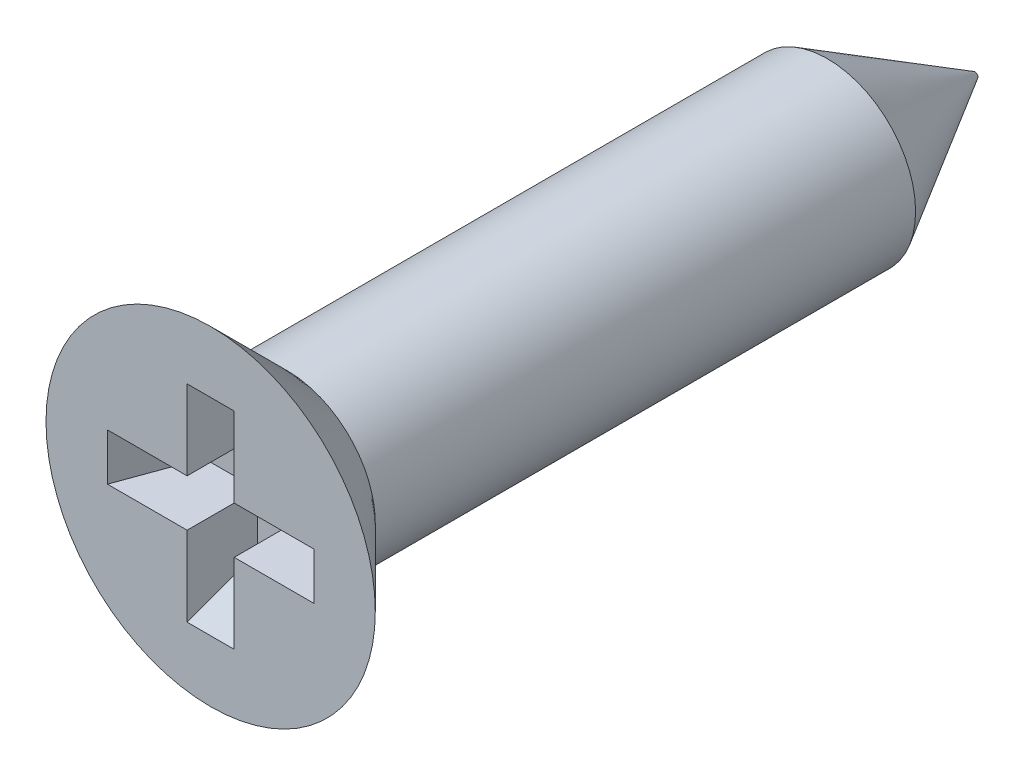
ISO-10303-21;
HEADER;
FILE_DESCRIPTION(('STEP AP214'),'2;1');
FILE_NAME('part.step','',(''),(''),'','','');
FILE_SCHEMA(('AUTOMOTIVE_DESIGN { 1 0 10303 214 1 1 1 1 }'));
ENDSEC;
DATA;
#1=APPLICATION_CONTEXT('core data for automotive mechanical design processes');
#2=APPLICATION_PROTOCOL_DEFINITION('international standard','automotive_design',2000,#1);
#3=PRODUCT_CONTEXT('',#1,'mechanical');
#4=PRODUCT('Part','Part','',(#3));
#5=PRODUCT_RELATED_PRODUCT_CATEGORY('part','',(#4));
#6=PRODUCT_DEFINITION_FORMATION('','',#4);
#7=PRODUCT_DEFINITION_CONTEXT('part definition',#1,'design');
#8=PRODUCT_DEFINITION('design','',#6,#7);
#9=PRODUCT_DEFINITION_SHAPE('','',#8);
#10=(LENGTH_UNIT() NAMED_UNIT(*) SI_UNIT(.MILLI.,.METRE.));
#11=(NAMED_UNIT(*) PLANE_ANGLE_UNIT() SI_UNIT($,.RADIAN.));
#12=(NAMED_UNIT(*) SI_UNIT($,.STERADIAN.) SOLID_ANGLE_UNIT());
#13=UNCERTAINTY_MEASURE_WITH_UNIT(LENGTH_MEASURE(1.E-05),#10,'distance_accuracy_value','');
#14=(GEOMETRIC_REPRESENTATION_CONTEXT(3) GLOBAL_UNCERTAINTY_ASSIGNED_CONTEXT((#13)) GLOBAL_UNIT_ASSIGNED_CONTEXT((#10,
#11,#12)) REPRESENTATION_CONTEXT('',''));
#15=CARTESIAN_POINT('',(0.,0.,0.));
#16=DIRECTION('',(0.,0.,1.));
#17=DIRECTION('',(1.,0.,0.));
#18=AXIS2_PLACEMENT_3D('',#15,#16,#17);
#19=CARTESIAN_POINT('',(0.4,0.4,-1.2));
#20=DIRECTION('',(0.,1.,0.));
#21=DIRECTION('',(-1.,0.,0.));
#22=AXIS2_PLACEMENT_3D('',#19,#20,#21);
#23=PLANE('',#22);
#24=DIRECTION('',(-0.34202014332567,0.,-0.939692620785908));
#25=VECTOR('',#24,1.);
#26=CARTESIAN_POINT('',(1.75499287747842,0.4,0.));
#27=LINE('',#26,#25);
#28=CARTESIAN_POINT('',(1.19429770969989,0.4,-1.54049731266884));
#29=VERTEX_POINT('',#28);
#30=CARTESIAN_POINT('',(1.31822859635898,0.4,-1.2));
#31=VERTEX_POINT('',#30);
#32=EDGE_CURVE('E313',#29,#31,#27,.F.);
#33=ORIENTED_EDGE('',*,*,#32,.T.);
#34=DIRECTION('',(-1.,0.,0.));
#35=VECTOR('',#34,1.);
#36=CARTESIAN_POINT('',(0.4,0.4,-1.2));
#37=LINE('',#36,#35);
#38=CARTESIAN_POINT('',(1.54919333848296,0.4,-1.2));
#39=VERTEX_POINT('',#38);
#40=EDGE_CURVE('E454',#39,#31,#37,.T.);
#41=ORIENTED_EDGE('',*,*,#40,.F.);
#42=CARTESIAN_POINT('',(3.05465508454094,0.4,0.280733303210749));
#43=CARTESIAN_POINT('',(2.93740544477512,0.4,0.164488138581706));
#44=CARTESIAN_POINT('',(2.82011039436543,0.4,0.0482885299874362));
#45=CARTESIAN_POINT('',(2.58535518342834,0.4,-0.183944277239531));
#46=CARTESIAN_POINT('',(2.46789502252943,0.4,-0.299977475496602));
#47=CARTESIAN_POINT('',(2.23276367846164,0.4,-0.531774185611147));
#48=CARTESIAN_POINT('',(2.11509255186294,0.4,-0.647537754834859));
#49=CARTESIAN_POINT('',(1.87936564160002,0.4,-0.878680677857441));
#50=CARTESIAN_POINT('',(1.7613098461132,0.4,-0.994060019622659));
#51=CARTESIAN_POINT('',(1.56030925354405,0.4,-1.18935151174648));
#52=CARTESIAN_POINT('',(1.47753807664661,0.4,-1.26944225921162));
#53=CARTESIAN_POINT('',(1.31147700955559,0.4,-1.42907447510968));
#54=CARTESIAN_POINT('',(1.22818715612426,0.4,-1.5086159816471));
#55=CARTESIAN_POINT('',(1.10255289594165,0.4,-1.62721046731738));
#56=CARTESIAN_POINT('',(1.06055264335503,0.4,-1.66662748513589));
#57=CARTESIAN_POINT('',(0.976229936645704,0.4,-1.74511218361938));
#58=CARTESIAN_POINT('',(0.933907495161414,0.4,-1.7841798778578));
#59=CARTESIAN_POINT('',(0.848803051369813,0.4,-1.86183524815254));
#60=CARTESIAN_POINT('',(0.806020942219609,0.4,-1.90042280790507));
#61=CARTESIAN_POINT('',(0.719742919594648,0.4,-1.97680170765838));
#62=CARTESIAN_POINT('',(0.676246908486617,0.4,-2.01459293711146));
#63=CARTESIAN_POINT('',(0.632267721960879,0.4,-2.05182724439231));
#64=B_SPLINE_CURVE_WITH_KNOTS('',3,(#42,#43,#44,#45,#46,#47,#48,#49,#50,#51,#52,#53,#54,#55,#56,
#57,#58,#59,#60,#61,#62,#63),.UNSPECIFIED.,.F.,.F.,(4,2,2,2,2,2,2,2,2,2,4),(0.,
0.495322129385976,0.990645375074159,1.48585130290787,1.98107259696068,2.32660062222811,
2.67210443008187,2.84490192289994,3.01769267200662,3.19052449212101,3.36338014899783),.UNSPECIFIED.);
#65=CARTESIAN_POINT('',(1.4456832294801,0.4,-1.3));
#66=VERTEX_POINT('',#65);
#67=EDGE_CURVE('E311',#66,#39,#64,.F.);
#68=ORIENTED_EDGE('',*,*,#67,.F.);
#69=EDGE_CURVE('E346',#29,#66,#64,.F.);
#70=ORIENTED_EDGE('',*,*,#69,.F.);
#71=EDGE_LOOP('',(#33,#41,#68,#70));
#72=FACE_BOUND('',#71,.T.);
#73=ADVANCED_FACE('F33',(#72),#23,.T.);
#74=CARTESIAN_POINT('',(0.4,-0.4,-1.2));
#75=DIRECTION('',(0.,-1.,0.));
#76=DIRECTION('',(1.,0.,0.));
#77=AXIS2_PLACEMENT_3D('',#74,#75,#76);
#78=PLANE('',#77);
#79=DIRECTION('',(1.,0.,0.));
#80=VECTOR('',#79,1.);
#81=CARTESIAN_POINT('',(0.4,-0.4,-1.2));
#82=LINE('',#81,#80);
#83=CARTESIAN_POINT('',(1.31822859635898,-0.4,-1.2));
#84=VERTEX_POINT('',#83);
#85=CARTESIAN_POINT('',(1.54919333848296,-0.4,-1.2));
#86=VERTEX_POINT('',#85);
#87=EDGE_CURVE('E450',#84,#86,#82,.T.);
#88=ORIENTED_EDGE('',*,*,#87,.F.);
#89=DIRECTION('',(-0.34202014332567,0.,-0.939692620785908));
#90=VECTOR('',#89,1.);
#91=CARTESIAN_POINT('',(1.21081625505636,-0.4,-1.49511298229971));
#92=LINE('',#91,#90);
#93=CARTESIAN_POINT('',(1.19429770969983,-0.4,-1.54049731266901));
#94=VERTEX_POINT('',#93);
#95=EDGE_CURVE('E304',#94,#84,#92,.F.);
#96=ORIENTED_EDGE('',*,*,#95,.F.);
#97=CARTESIAN_POINT('',(0.63226772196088,-0.4,-2.05182724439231));
#98=CARTESIAN_POINT('',(0.660191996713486,-0.4,-2.02821617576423));
#99=CARTESIAN_POINT('',(0.687907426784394,-0.4,-2.0043616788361));
#100=CARTESIAN_POINT('',(0.743005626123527,-0.4,-1.95627497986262));
#101=CARTESIAN_POINT('',(0.770388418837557,-0.4,-1.93204280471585));
#102=CARTESIAN_POINT('',(0.852162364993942,-0.4,-1.85894632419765));
#103=CARTESIAN_POINT('',(0.906188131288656,-0.4,-1.80967429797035));
#104=CARTESIAN_POINT('',(1.01362648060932,-0.4,-1.71049682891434));
#105=CARTESIAN_POINT('',(1.06703921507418,-0.4,-1.66059154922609));
#106=CARTESIAN_POINT('',(1.17347006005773,-0.4,-1.56035783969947));
#107=CARTESIAN_POINT('',(1.22648815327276,-0.4,-1.51002939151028));
#108=CARTESIAN_POINT('',(1.34024896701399,-0.4,-1.40145173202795));
#109=CARTESIAN_POINT('',(1.40094711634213,-0.4,-1.34315589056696));
#110=CARTESIAN_POINT('',(1.52209811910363,-0.4,-1.22630068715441));
#111=CARTESIAN_POINT('',(1.58255095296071,-0.4,-1.16774130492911));
#112=CARTESIAN_POINT('',(1.76134065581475,-0.4,-0.994030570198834));
#113=CARTESIAN_POINT('',(1.87942666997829,-0.4,-0.878621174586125));
#114=CARTESIAN_POINT('',(2.11521819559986,-0.4,-0.647414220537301));
#115=CARTESIAN_POINT('',(2.23292370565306,-0.4,-0.531616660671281));
#116=CARTESIAN_POINT('',(2.46805734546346,-0.4,-0.299817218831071));
#117=CARTESIAN_POINT('',(2.58548555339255,-0.4,-0.183815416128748));
#118=CARTESIAN_POINT('',(2.82017598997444,-0.4,0.0483535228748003));
#119=CARTESIAN_POINT('',(2.93743822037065,-0.4,0.164520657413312));
#120=CARTESIAN_POINT('',(3.05465508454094,-0.4,0.280733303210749));
#121=B_SPLINE_CURVE_WITH_KNOTS('',3,(#97,#98,#99,#100,#101,#102,#103,#104,#105,#106,#107,#108,
#109,#110,#111,#112,#113,#114,#115,#116,#117,#118,#119,#120),.UNSPECIFIED.,.F.,.F.,(4,2,2,2,2,2,
2,2,2,2,2,4),(0.,0.109700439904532,0.219393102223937,0.438742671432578,0.658036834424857,
0.877340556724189,1.12981526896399,1.38230974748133,1.87765889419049,2.3730098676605,
2.86819872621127,3.36338234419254),.UNSPECIFIED.);
#122=CARTESIAN_POINT('',(1.4456832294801,-0.4,-1.3));
#123=VERTEX_POINT('',#122);
#124=EDGE_CURVE('E410',#123,#94,#121,.F.);
#125=ORIENTED_EDGE('',*,*,#124,.F.);
#126=EDGE_CURVE('E312',#86,#123,#121,.F.);
#127=ORIENTED_EDGE('',*,*,#126,.F.);
#128=EDGE_LOOP('',(#88,#96,#125,#127));
#129=FACE_BOUND('',#128,.T.);
#130=ADVANCED_FACE('F327',(#129),#78,.T.);
#131=CARTESIAN_POINT('',(-0.4,1.75499287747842,-1.2));
#132=DIRECTION('',(-1.,0.,0.));
#133=DIRECTION('',(0.,-1.,0.));
#134=AXIS2_PLACEMENT_3D('',#131,#132,#133);
#135=PLANE('',#134);
#136=DIRECTION('',(0.,-0.34202014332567,-0.939692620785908));
#137=VECTOR('',#136,1.);
#138=CARTESIAN_POINT('',(-0.4,1.75499287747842,0.));
#139=LINE('',#138,#137);
#140=CARTESIAN_POINT('',(-0.4,1.19429770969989,-1.54049731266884));
#141=VERTEX_POINT('',#140);
#142=CARTESIAN_POINT('',(-0.4,1.31822859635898,-1.2));
#143=VERTEX_POINT('',#142);
#144=EDGE_CURVE('E298',#141,#143,#139,.F.);
#145=ORIENTED_EDGE('',*,*,#144,.T.);
#146=DIRECTION('',(0.,-1.,0.));
#147=VECTOR('',#146,1.);
#148=CARTESIAN_POINT('',(-0.4,1.75499287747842,-1.2));
#149=LINE('',#148,#147);
#150=CARTESIAN_POINT('',(-0.4,1.54919333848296,-1.2));
#151=VERTEX_POINT('',#150);
#152=EDGE_CURVE('E462',#151,#143,#149,.T.);
#153=ORIENTED_EDGE('',*,*,#152,.F.);
#154=CARTESIAN_POINT('',(-0.4,3.05465508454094,0.280733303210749));
#155=CARTESIAN_POINT('',(-0.4,2.93740544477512,0.164488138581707));
#156=CARTESIAN_POINT('',(-0.4,2.82011039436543,0.0482885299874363));
#157=CARTESIAN_POINT('',(-0.4,2.58535518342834,-0.183944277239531));
#158=CARTESIAN_POINT('',(-0.4,2.46789502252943,-0.299977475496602));
#159=CARTESIAN_POINT('',(-0.4,2.23276367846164,-0.531774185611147));
#160=CARTESIAN_POINT('',(-0.4,2.11509255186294,-0.647537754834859));
#161=CARTESIAN_POINT('',(-0.4,1.87936564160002,-0.878680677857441));
#162=CARTESIAN_POINT('',(-0.4,1.7613098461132,-0.994060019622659));
#163=CARTESIAN_POINT('',(-0.4,1.56030925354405,-1.18935151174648));
#164=CARTESIAN_POINT('',(-0.4,1.47753807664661,-1.26944225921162));
#165=CARTESIAN_POINT('',(-0.4,1.3114770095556,-1.42907447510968));
#166=CARTESIAN_POINT('',(-0.4,1.22818715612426,-1.5086159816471));
#167=CARTESIAN_POINT('',(-0.4,1.10255289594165,-1.62721046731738));
#168=CARTESIAN_POINT('',(-0.4,1.06055264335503,-1.66662748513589));
#169=CARTESIAN_POINT('',(-0.4,0.976229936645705,-1.74511218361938));
#170=CARTESIAN_POINT('',(-0.4,0.933907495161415,-1.7841798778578));
#171=CARTESIAN_POINT('',(-0.4,0.848803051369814,-1.86183524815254));
#172=CARTESIAN_POINT('',(-0.4,0.80602094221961,-1.90042280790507));
#173=CARTESIAN_POINT('',(-0.4,0.719742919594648,-1.97680170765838));
#174=CARTESIAN_POINT('',(-0.4,0.676246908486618,-2.01459293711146));
#175=CARTESIAN_POINT('',(-0.4,0.63226772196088,-2.05182724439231));
#176=B_SPLINE_CURVE_WITH_KNOTS('',3,(#154,#155,#156,#157,#158,#159,#160,#161,#162,#163,#164,
#165,#166,#167,#168,#169,#170,#171,#172,#173,#174,#175),.UNSPECIFIED.,.F.,.F.,(4,2,2,2,2,2,2,2,
2,2,4),(0.,0.495322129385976,0.990645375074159,1.48585130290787,1.98107259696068,
2.32660062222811,2.67210443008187,2.84490192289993,3.01769267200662,3.19052449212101,
3.36338014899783),.UNSPECIFIED.);
#177=CARTESIAN_POINT('',(-0.4,1.4456832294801,-1.3));
#178=VERTEX_POINT('',#177);
#179=EDGE_CURVE('E296',#178,#151,#176,.F.);
#180=ORIENTED_EDGE('',*,*,#179,.F.);
#181=EDGE_CURVE('E362',#141,#178,#176,.F.);
#182=ORIENTED_EDGE('',*,*,#181,.F.);
#183=EDGE_LOOP('',(#145,#153,#180,#182));
#184=FACE_BOUND('',#183,.T.);
#185=ADVANCED_FACE('F337',(#184),#135,.T.);
#186=CARTESIAN_POINT('',(0.4,1.75499287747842,-1.2));
#187=DIRECTION('',(1.,0.,0.));
#188=DIRECTION('',(0.,0.,-1.));
#189=AXIS2_PLACEMENT_3D('',#186,#187,#188);
#190=PLANE('',#189);
#191=DIRECTION('',(0.,1.,0.));
#192=VECTOR('',#191,1.);
#193=CARTESIAN_POINT('',(0.4,1.75499287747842,-1.2));
#194=LINE('',#193,#192);
#195=CARTESIAN_POINT('',(0.4,1.31822859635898,-1.2));
#196=VERTEX_POINT('',#195);
#197=CARTESIAN_POINT('',(0.4,1.54919333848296,-1.2));
#198=VERTEX_POINT('',#197);
#199=EDGE_CURVE('E459',#196,#198,#194,.T.);
#200=ORIENTED_EDGE('',*,*,#199,.F.);
#201=DIRECTION('',(0.,-0.34202014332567,-0.939692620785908));
#202=VECTOR('',#201,1.);
#203=CARTESIAN_POINT('',(0.4,1.3693203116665,-1.05962666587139));
#204=LINE('',#203,#202);
#205=CARTESIAN_POINT('',(0.4,1.19429770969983,-1.54049731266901));
#206=VERTEX_POINT('',#205);
#207=EDGE_CURVE('E289',#206,#196,#204,.F.);
#208=ORIENTED_EDGE('',*,*,#207,.F.);
#209=CARTESIAN_POINT('',(0.4,0.632267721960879,-2.05182724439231));
#210=CARTESIAN_POINT('',(0.4,0.660191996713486,-2.02821617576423));
#211=CARTESIAN_POINT('',(0.4,0.687907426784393,-2.00436167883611));
#212=CARTESIAN_POINT('',(0.4,0.743005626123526,-1.95627497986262));
#213=CARTESIAN_POINT('',(0.4,0.770388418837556,-1.93204280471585));
#214=CARTESIAN_POINT('',(0.4,0.852162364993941,-1.85894632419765));
#215=CARTESIAN_POINT('',(0.4,0.906188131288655,-1.80967429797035));
#216=CARTESIAN_POINT('',(0.4,1.01362648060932,-1.71049682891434));
#217=CARTESIAN_POINT('',(0.4,1.06703921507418,-1.66059154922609));
#218=CARTESIAN_POINT('',(0.4,1.17347006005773,-1.56035783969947));
#219=CARTESIAN_POINT('',(0.4,1.22648815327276,-1.51002939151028));
#220=CARTESIAN_POINT('',(0.4,1.34024896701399,-1.40145173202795));
#221=CARTESIAN_POINT('',(0.4,1.40094711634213,-1.34315589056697));
#222=CARTESIAN_POINT('',(0.4,1.52209811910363,-1.22630068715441));
#223=CARTESIAN_POINT('',(0.4,1.58255095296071,-1.16774130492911));
#224=CARTESIAN_POINT('',(0.4,1.76134065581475,-0.994030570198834));
#225=CARTESIAN_POINT('',(0.4,1.87942666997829,-0.878621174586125));
#226=CARTESIAN_POINT('',(0.4,2.11521819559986,-0.647414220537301));
#227=CARTESIAN_POINT('',(0.4,2.23292370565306,-0.53161666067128));
#228=CARTESIAN_POINT('',(0.4,2.46805734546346,-0.299817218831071));
#229=CARTESIAN_POINT('',(0.4,2.58548555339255,-0.183815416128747));
#230=CARTESIAN_POINT('',(0.4,2.82017598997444,0.0483535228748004));
#231=CARTESIAN_POINT('',(0.4,2.93743822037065,0.164520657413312));
#232=CARTESIAN_POINT('',(0.4,3.05465508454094,0.280733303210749));
#233=B_SPLINE_CURVE_WITH_KNOTS('',3,(#209,#210,#211,#212,#213,#214,#215,#216,#217,#218,#219,
#220,#221,#222,#223,#224,#225,#226,#227,#228,#229,#230,#231,#232),.UNSPECIFIED.,.F.,.F.,(4,2,2,
2,2,2,2,2,2,2,2,4),(0.,0.109700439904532,0.219393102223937,0.438742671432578,0.658036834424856,
0.877340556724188,1.12981526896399,1.38230974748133,1.8776588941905,2.3730098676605,
2.86819872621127,3.36338234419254),.UNSPECIFIED.);
#234=CARTESIAN_POINT('',(0.4,1.4456832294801,-1.3));
#235=VERTEX_POINT('',#234);
#236=EDGE_CURVE('E352',#235,#206,#233,.F.);
#237=ORIENTED_EDGE('',*,*,#236,.F.);
#238=EDGE_CURVE('E297',#198,#235,#233,.F.);
#239=ORIENTED_EDGE('',*,*,#238,.F.);
#240=EDGE_LOOP('',(#200,#208,#237,#239));
#241=FACE_BOUND('',#240,.T.);
#242=ADVANCED_FACE('F423',(#241),#190,.T.);
#243=CARTESIAN_POINT('',(0.4,-0.4,-1.2));
#244=DIRECTION('',(1.,0.,0.));
#245=DIRECTION('',(0.,1.,0.));
#246=AXIS2_PLACEMENT_3D('',#243,#244,#245);
#247=PLANE('',#246);
#248=DIRECTION('',(0.,0.34202014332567,-0.939692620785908));
#249=VECTOR('',#248,1.);
#250=CARTESIAN_POINT('',(0.4,-1.75499287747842,0.));
#251=LINE('',#250,#249);
#252=CARTESIAN_POINT('',(0.4,-1.19429770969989,-1.54049731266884));
#253=VERTEX_POINT('',#252);
#254=CARTESIAN_POINT('',(0.4,-1.31822859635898,-1.2));
#255=VERTEX_POINT('',#254);
#256=EDGE_CURVE('E283',#253,#255,#251,.F.);
#257=ORIENTED_EDGE('',*,*,#256,.T.);
#258=DIRECTION('',(0.,1.,0.));
#259=VECTOR('',#258,1.);
#260=CARTESIAN_POINT('',(0.4,-0.4,-1.2));
#261=LINE('',#260,#259);
#262=CARTESIAN_POINT('',(0.4,-1.54919333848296,-1.2));
#263=VERTEX_POINT('',#262);
#264=EDGE_CURVE('E436',#263,#255,#261,.T.);
#265=ORIENTED_EDGE('',*,*,#264,.F.);
#266=CARTESIAN_POINT('',(0.4,-3.05465508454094,0.280733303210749));
#267=CARTESIAN_POINT('',(0.4,-2.93740544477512,0.164488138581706));
#268=CARTESIAN_POINT('',(0.4,-2.82011039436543,0.0482885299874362));
#269=CARTESIAN_POINT('',(0.4,-2.58535518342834,-0.183944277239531));
#270=CARTESIAN_POINT('',(0.4,-2.46789502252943,-0.299977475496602));
#271=CARTESIAN_POINT('',(0.4,-2.23276367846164,-0.531774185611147));
#272=CARTESIAN_POINT('',(0.4,-2.11509255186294,-0.647537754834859));
#273=CARTESIAN_POINT('',(0.4,-1.87936564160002,-0.878680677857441));
#274=CARTESIAN_POINT('',(0.4,-1.7613098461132,-0.994060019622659));
#275=CARTESIAN_POINT('',(0.4,-1.56030925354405,-1.18935151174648));
#276=CARTESIAN_POINT('',(0.4,-1.47753807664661,-1.26944225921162));
#277=CARTESIAN_POINT('',(0.4,-1.31147700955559,-1.42907447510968));
#278=CARTESIAN_POINT('',(0.4,-1.22818715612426,-1.5086159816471));
#279=CARTESIAN_POINT('',(0.4,-1.10255289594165,-1.62721046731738));
#280=CARTESIAN_POINT('',(0.4,-1.06055264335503,-1.66662748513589));
#281=CARTESIAN_POINT('',(0.4,-0.976229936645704,-1.74511218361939));
#282=CARTESIAN_POINT('',(0.4,-0.933907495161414,-1.7841798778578));
#283=CARTESIAN_POINT('',(0.4,-0.848803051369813,-1.86183524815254));
#284=CARTESIAN_POINT('',(0.4,-0.806020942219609,-1.90042280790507));
#285=CARTESIAN_POINT('',(0.4,-0.719742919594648,-1.97680170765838));
#286=CARTESIAN_POINT('',(0.4,-0.676246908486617,-2.01459293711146));
#287=CARTESIAN_POINT('',(0.4,-0.632267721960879,-2.05182724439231));
#288=B_SPLINE_CURVE_WITH_KNOTS('',3,(#266,#267,#268,#269,#270,#271,#272,#273,#274,#275,#276,
#277,#278,#279,#280,#281,#282,#283,#284,#285,#286,#287),.UNSPECIFIED.,.F.,.F.,(4,2,2,2,2,2,2,2,
2,2,4),(0.,0.495322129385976,0.990645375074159,1.48585130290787,1.98107259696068,
2.32660062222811,2.67210443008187,2.84490192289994,3.01769267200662,3.19052449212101,
3.36338014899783),.UNSPECIFIED.);
#289=CARTESIAN_POINT('',(0.4,-1.4456832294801,-1.3));
#290=VERTEX_POINT('',#289);
#291=EDGE_CURVE('E281',#290,#263,#288,.F.);
#292=ORIENTED_EDGE('',*,*,#291,.F.);
#293=EDGE_CURVE('E405',#253,#290,#288,.F.);
#294=ORIENTED_EDGE('',*,*,#293,.F.);
#295=EDGE_LOOP('',(#257,#265,#292,#294));
#296=FACE_BOUND('',#295,.T.);
#297=ADVANCED_FACE('F417',(#296),#247,.T.);
#298=CARTESIAN_POINT('',(-0.4,-0.4,-1.2));
#299=DIRECTION('',(-1.,0.,0.));
#300=DIRECTION('',(0.,-1.,0.));
#301=AXIS2_PLACEMENT_3D('',#298,#299,#300);
#302=PLANE('',#301);
#303=DIRECTION('',(0.,-1.,0.));
#304=VECTOR('',#303,1.);
#305=CARTESIAN_POINT('',(-0.4,-0.4,-1.2));
#306=LINE('',#305,#304);
#307=CARTESIAN_POINT('',(-0.4,-1.31822859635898,-1.2));
#308=VERTEX_POINT('',#307);
#309=CARTESIAN_POINT('',(-0.4,-1.54919333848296,-1.2));
#310=VERTEX_POINT('',#309);
#311=EDGE_CURVE('E207',#308,#310,#306,.T.);
#312=ORIENTED_EDGE('',*,*,#311,.F.);
#313=DIRECTION('',(0.,0.34202014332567,-0.939692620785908));
#314=VECTOR('',#313,1.);
#315=CARTESIAN_POINT('',(-0.4,-1.21081625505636,-1.49511298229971));
#316=LINE('',#315,#314);
#317=CARTESIAN_POINT('',(-0.4,-1.19429770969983,-1.54049731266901));
#318=VERTEX_POINT('',#317);
#319=EDGE_CURVE('E222',#318,#308,#316,.F.);
#320=ORIENTED_EDGE('',*,*,#319,.F.);
#321=CARTESIAN_POINT('',(-0.4,-0.632267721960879,-2.05182724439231));
#322=CARTESIAN_POINT('',(-0.4,-0.660191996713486,-2.02821617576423));
#323=CARTESIAN_POINT('',(-0.4,-0.687907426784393,-2.00436167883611));
#324=CARTESIAN_POINT('',(-0.4,-0.743005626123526,-1.95627497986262));
#325=CARTESIAN_POINT('',(-0.4,-0.770388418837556,-1.93204280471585));
#326=CARTESIAN_POINT('',(-0.4,-0.852162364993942,-1.85894632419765));
#327=CARTESIAN_POINT('',(-0.4,-0.906188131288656,-1.80967429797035));
#328=CARTESIAN_POINT('',(-0.4,-1.01362648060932,-1.71049682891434));
#329=CARTESIAN_POINT('',(-0.4,-1.06703921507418,-1.66059154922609));
#330=CARTESIAN_POINT('',(-0.4,-1.17347006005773,-1.56035783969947));
#331=CARTESIAN_POINT('',(-0.4,-1.22648815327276,-1.51002939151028));
#332=CARTESIAN_POINT('',(-0.4,-1.34024896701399,-1.40145173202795));
#333=CARTESIAN_POINT('',(-0.4,-1.40094711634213,-1.34315589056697));
#334=CARTESIAN_POINT('',(-0.4,-1.52209811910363,-1.22630068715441));
#335=CARTESIAN_POINT('',(-0.4,-1.58255095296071,-1.16774130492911));
#336=CARTESIAN_POINT('',(-0.4,-1.76134065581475,-0.994030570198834));
#337=CARTESIAN_POINT('',(-0.4,-1.87942666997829,-0.878621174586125));
#338=CARTESIAN_POINT('',(-0.4,-2.11521819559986,-0.647414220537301));
#339=CARTESIAN_POINT('',(-0.4,-2.23292370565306,-0.53161666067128));
#340=CARTESIAN_POINT('',(-0.4,-2.46805734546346,-0.29981721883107));
#341=CARTESIAN_POINT('',(-0.4,-2.58548555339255,-0.183815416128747));
#342=CARTESIAN_POINT('',(-0.4,-2.82017598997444,0.0483535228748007));
#343=CARTESIAN_POINT('',(-0.4,-2.93743822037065,0.164520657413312));
#344=CARTESIAN_POINT('',(-0.4,-3.05465508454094,0.280733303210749));
#345=B_SPLINE_CURVE_WITH_KNOTS('',3,(#321,#322,#323,#324,#325,#326,#327,#328,#329,#330,#331,
#332,#333,#334,#335,#336,#337,#338,#339,#340,#341,#342,#343,#344),.UNSPECIFIED.,.F.,.F.,(4,2,2,
2,2,2,2,2,2,2,2,4),(0.,0.109700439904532,0.219393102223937,0.438742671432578,0.658036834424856,
0.877340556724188,1.12981526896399,1.38230974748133,1.8776588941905,2.3730098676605,
2.86819872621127,3.36338234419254),.UNSPECIFIED.);
#346=CARTESIAN_POINT('',(-0.4,-1.4456832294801,-1.3));
#347=VERTEX_POINT('',#346);
#348=EDGE_CURVE('E253',#347,#318,#345,.F.);
#349=ORIENTED_EDGE('',*,*,#348,.F.);
#350=EDGE_CURVE('E282',#310,#347,#345,.F.);
#351=ORIENTED_EDGE('',*,*,#350,.F.);
#352=EDGE_LOOP('',(#312,#320,#349,#351));
#353=FACE_BOUND('',#352,.T.);
#354=ADVANCED_FACE('F422',(#353),#302,.T.);
#355=CARTESIAN_POINT('',(-1.75499287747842,-0.4,-1.2));
#356=DIRECTION('',(0.,-1.,0.));
#357=DIRECTION('',(1.,0.,0.));
#358=AXIS2_PLACEMENT_3D('',#355,#356,#357);
#359=PLANE('',#358);
#360=DIRECTION('',(0.34202014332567,0.,-0.939692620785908));
#361=VECTOR('',#360,1.);
#362=CARTESIAN_POINT('',(-1.75499287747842,-0.4,0.));
#363=LINE('',#362,#361);
#364=CARTESIAN_POINT('',(-1.19429770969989,-0.4,-1.54049731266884));
#365=VERTEX_POINT('',#364);
#366=CARTESIAN_POINT('',(-1.31822859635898,-0.4,-1.2));
#367=VERTEX_POINT('',#366);
#368=EDGE_CURVE('E223',#365,#367,#363,.F.);
#369=ORIENTED_EDGE('',*,*,#368,.T.);
#370=DIRECTION('',(1.,0.,0.));
#371=VECTOR('',#370,1.);
#372=CARTESIAN_POINT('',(-1.75499287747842,-0.4,-1.2));
#373=LINE('',#372,#371);
#374=CARTESIAN_POINT('',(-1.54919333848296,-0.4,-1.2));
#375=VERTEX_POINT('',#374);
#376=EDGE_CURVE('E215',#375,#367,#373,.T.);
#377=ORIENTED_EDGE('',*,*,#376,.F.);
#378=CARTESIAN_POINT('',(-3.05465508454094,-0.4,0.280733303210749));
#379=CARTESIAN_POINT('',(-2.93740544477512,-0.4,0.164488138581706));
#380=CARTESIAN_POINT('',(-2.82011039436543,-0.4,0.0482885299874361));
#381=CARTESIAN_POINT('',(-2.58535518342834,-0.4,-0.183944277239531));
#382=CARTESIAN_POINT('',(-2.46789502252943,-0.4,-0.299977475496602));
#383=CARTESIAN_POINT('',(-2.23276367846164,-0.4,-0.531774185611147));
#384=CARTESIAN_POINT('',(-2.11509255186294,-0.4,-0.647537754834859));
#385=CARTESIAN_POINT('',(-1.87936564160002,-0.4,-0.878680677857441));
#386=CARTESIAN_POINT('',(-1.7613098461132,-0.4,-0.994060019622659));
#387=CARTESIAN_POINT('',(-1.56030925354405,-0.4,-1.18935151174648));
#388=CARTESIAN_POINT('',(-1.47753807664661,-0.4,-1.26944225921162));
#389=CARTESIAN_POINT('',(-1.3114770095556,-0.4,-1.42907447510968));
#390=CARTESIAN_POINT('',(-1.22818715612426,-0.4,-1.5086159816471));
#391=CARTESIAN_POINT('',(-1.10255289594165,-0.4,-1.62721046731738));
#392=CARTESIAN_POINT('',(-1.06055264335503,-0.4,-1.66662748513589));
#393=CARTESIAN_POINT('',(-0.976229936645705,-0.4,-1.74511218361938));
#394=CARTESIAN_POINT('',(-0.933907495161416,-0.4,-1.78417987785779));
#395=CARTESIAN_POINT('',(-0.848803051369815,-0.4,-1.86183524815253));
#396=CARTESIAN_POINT('',(-0.806020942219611,-0.4,-1.90042280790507));
#397=CARTESIAN_POINT('',(-0.719742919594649,-0.4,-1.97680170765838));
#398=CARTESIAN_POINT('',(-0.676246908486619,-0.4,-2.01459293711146));
#399=CARTESIAN_POINT('',(-0.632267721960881,-0.4,-2.05182724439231));
#400=B_SPLINE_CURVE_WITH_KNOTS('',3,(#378,#379,#380,#381,#382,#383,#384,#385,#386,#387,#388,
#389,#390,#391,#392,#393,#394,#395,#396,#397,#398,#399),.UNSPECIFIED.,.F.,.F.,(4,2,2,2,2,2,2,2,
2,2,4),(0.,0.495322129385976,0.990645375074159,1.48585130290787,1.98107259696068,
2.32660062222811,2.67210443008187,2.84490192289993,3.01769267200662,3.19052449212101,
3.36338014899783),.UNSPECIFIED.);
#401=CARTESIAN_POINT('',(-1.4456832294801,-0.4,-1.3));
#402=VERTEX_POINT('',#401);
#403=EDGE_CURVE('E48',#402,#375,#400,.F.);
#404=ORIENTED_EDGE('',*,*,#403,.F.);
#405=EDGE_CURVE('E389',#365,#402,#400,.F.);
#406=ORIENTED_EDGE('',*,*,#405,.F.);
#407=EDGE_LOOP('',(#369,#377,#404,#406));
#408=FACE_BOUND('',#407,.T.);
#409=ADVANCED_FACE('F386',(#408),#359,.T.);
#410=CARTESIAN_POINT('',(0.,0.,-1.3));
#411=DIRECTION('',(0.,0.,1.));
#412=DIRECTION('',(1.,0.,0.));
#413=AXIS2_PLACEMENT_3D('',#410,#411,#412);
#414=CONICAL_SURFACE('',#413,1.5,0.78539816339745);
#415=CARTESIAN_POINT('',(-0.632267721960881,0.4,-2.05182724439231));
#416=CARTESIAN_POINT('',(-0.660191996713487,0.4,-2.02821617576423));
#417=CARTESIAN_POINT('',(-0.687907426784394,0.4,-2.0043616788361));
#418=CARTESIAN_POINT('',(-0.743005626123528,0.4,-1.95627497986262));
#419=CARTESIAN_POINT('',(-0.770388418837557,0.4,-1.93204280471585));
#420=CARTESIAN_POINT('',(-0.852162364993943,0.4,-1.85894632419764));
#421=CARTESIAN_POINT('',(-0.906188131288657,0.4,-1.80967429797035));
#422=CARTESIAN_POINT('',(-1.01362648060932,0.4,-1.71049682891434));
#423=CARTESIAN_POINT('',(-1.06703921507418,0.4,-1.66059154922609));
#424=CARTESIAN_POINT('',(-1.17347006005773,0.4,-1.56035783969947));
#425=CARTESIAN_POINT('',(-1.22648815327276,0.4,-1.51002939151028));
#426=CARTESIAN_POINT('',(-1.34024896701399,0.4,-1.40145173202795));
#427=CARTESIAN_POINT('',(-1.40094711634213,0.4,-1.34315589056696));
#428=CARTESIAN_POINT('',(-1.52209811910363,0.4,-1.22630068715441));
#429=CARTESIAN_POINT('',(-1.58255095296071,0.4,-1.16774130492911));
#430=CARTESIAN_POINT('',(-1.76134065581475,0.4,-0.994030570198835));
#431=CARTESIAN_POINT('',(-1.87942666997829,0.4,-0.878621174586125));
#432=CARTESIAN_POINT('',(-2.11521819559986,0.4,-0.647414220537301));
#433=CARTESIAN_POINT('',(-2.23292370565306,0.4,-0.53161666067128));
#434=CARTESIAN_POINT('',(-2.46805734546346,0.4,-0.299817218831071));
#435=CARTESIAN_POINT('',(-2.58548555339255,0.4,-0.183815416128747));
#436=CARTESIAN_POINT('',(-2.82017598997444,0.4,0.0483535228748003));
#437=CARTESIAN_POINT('',(-2.93743822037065,0.4,0.164520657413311));
#438=CARTESIAN_POINT('',(-3.05465508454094,0.4,0.280733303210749));
#439=B_SPLINE_CURVE_WITH_KNOTS('',3,(#415,#416,#417,#418,#419,#420,#421,#422,#423,#424,#425,
#426,#427,#428,#429,#430,#431,#432,#433,#434,#435,#436,#437,#438),.UNSPECIFIED.,.F.,.F.,(4,2,2,
2,2,2,2,2,2,2,2,4),(0.,0.109700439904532,0.219393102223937,0.438742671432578,0.658036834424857,
0.877340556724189,1.12981526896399,1.38230974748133,1.87765889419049,2.3730098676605,
2.86819872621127,3.36338234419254),.UNSPECIFIED.);
#440=CARTESIAN_POINT('',(-1.54919333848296,0.4,-1.2));
#441=VERTEX_POINT('',#440);
#442=CARTESIAN_POINT('',(-1.4456832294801,0.4,-1.3));
#443=VERTEX_POINT('',#442);
#444=EDGE_CURVE('E56',#441,#443,#439,.F.);
#445=ORIENTED_EDGE('',*,*,#444,.T.);
#446=CARTESIAN_POINT('',(0.,0.,-1.3));
#447=DIRECTION('',(0.,0.,1.));
#448=DIRECTION('',(1.,0.,0.));
#449=AXIS2_PLACEMENT_3D('',#446,#447,#448);
#450=CIRCLE('',#449,1.5);
#451=EDGE_CURVE('E237',#443,#402,#450,.T.);
#452=ORIENTED_EDGE('',*,*,#451,.T.);
#453=ORIENTED_EDGE('',*,*,#403,.T.);
#454=CARTESIAN_POINT('',(0.,0.,-1.2));
#455=DIRECTION('',(0.,0.,-1.));
#456=DIRECTION('',(-1.,0.,0.));
#457=AXIS2_PLACEMENT_3D('',#454,#455,#456);
#458=CIRCLE('',#457,1.6);
#459=EDGE_CURVE('E240',#375,#441,#458,.T.);
#460=ORIENTED_EDGE('',*,*,#459,.T.);
#461=EDGE_LOOP('',(#445,#452,#453,#460));
#462=FACE_BOUND('',#461,.T.);
#463=ADVANCED_FACE('F592',(#462),#414,.T.);
#464=EDGE_CURVE('E543',#347,#290,#450,.T.);
#465=ORIENTED_EDGE('',*,*,#464,.T.);
#466=ORIENTED_EDGE('',*,*,#291,.T.);
#467=CARTESIAN_POINT('',(0.,0.,-1.2));
#468=DIRECTION('',(0.,0.,-1.));
#469=DIRECTION('',(-1.,0.,0.));
#470=AXIS2_PLACEMENT_3D('',#467,#468,#469);
#471=CIRCLE('',#470,1.6);
#472=EDGE_CURVE('E357',#263,#310,#471,.T.);
#473=ORIENTED_EDGE('',*,*,#472,.T.);
#474=ORIENTED_EDGE('',*,*,#350,.T.);
#475=EDGE_LOOP('',(#465,#466,#473,#474));
#476=FACE_BOUND('',#475,.T.);
#477=ADVANCED_FACE('F555',(#476),#414,.T.);
#478=EDGE_CURVE('E540',#123,#66,#450,.T.);
#479=ORIENTED_EDGE('',*,*,#478,.T.);
#480=ORIENTED_EDGE('',*,*,#67,.T.);
#481=CARTESIAN_POINT('',(0.,0.,-1.2));
#482=DIRECTION('',(0.,0.,-1.));
#483=DIRECTION('',(-1.,0.,0.));
#484=AXIS2_PLACEMENT_3D('',#481,#482,#483);
#485=CIRCLE('',#484,1.6);
#486=EDGE_CURVE('E361',#39,#86,#485,.T.);
#487=ORIENTED_EDGE('',*,*,#486,.T.);
#488=ORIENTED_EDGE('',*,*,#126,.T.);
#489=EDGE_LOOP('',(#479,#480,#487,#488));
#490=FACE_BOUND('',#489,.T.);
#491=ADVANCED_FACE('F545',(#490),#414,.T.);
#492=EDGE_CURVE('E232',#235,#178,#450,.T.);
#493=ORIENTED_EDGE('',*,*,#492,.T.);
#494=ORIENTED_EDGE('',*,*,#179,.T.);
#495=CARTESIAN_POINT('',(0.,0.,-1.2));
#496=DIRECTION('',(0.,0.,-1.));
#497=DIRECTION('',(-1.,0.,0.));
#498=AXIS2_PLACEMENT_3D('',#495,#496,#497);
#499=CIRCLE('',#498,1.6);
#500=EDGE_CURVE('E359',#151,#198,#499,.T.);
#501=ORIENTED_EDGE('',*,*,#500,.T.);
#502=ORIENTED_EDGE('',*,*,#238,.T.);
#503=EDGE_LOOP('',(#493,#494,#501,#502));
#504=FACE_BOUND('',#503,.T.);
#505=ADVANCED_FACE('F531',(#504),#414,.T.);
#506=CARTESIAN_POINT('',(-1.75499287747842,0.4,-1.2));
#507=DIRECTION('',(0.,1.,0.));
#508=DIRECTION('',(-1.,0.,0.));
#509=AXIS2_PLACEMENT_3D('',#506,#507,#508);
#510=PLANE('',#509);
#511=DIRECTION('',(-1.,0.,0.));
#512=VECTOR('',#511,1.);
#513=CARTESIAN_POINT('',(-1.75499287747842,0.4,-1.2));
#514=LINE('',#513,#512);
#515=CARTESIAN_POINT('',(-1.31822859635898,0.4,-1.2));
#516=VERTEX_POINT('',#515);
#517=EDGE_CURVE('E467',#516,#441,#514,.T.);
#518=ORIENTED_EDGE('',*,*,#517,.F.);
#519=DIRECTION('',(0.34202014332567,0.,-0.939692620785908));
#520=VECTOR('',#519,1.);
#521=CARTESIAN_POINT('',(-1.3693203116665,0.4,-1.05962666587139));
#522=LINE('',#521,#520);
#523=CARTESIAN_POINT('',(-1.19429770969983,0.4,-1.54049731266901));
#524=VERTEX_POINT('',#523);
#525=EDGE_CURVE('E245',#524,#516,#522,.F.);
#526=ORIENTED_EDGE('',*,*,#525,.F.);
#527=EDGE_CURVE('E395',#443,#524,#439,.F.);
#528=ORIENTED_EDGE('',*,*,#527,.F.);
#529=ORIENTED_EDGE('',*,*,#444,.F.);
#530=EDGE_LOOP('',(#518,#526,#528,#529));
#531=FACE_BOUND('',#530,.T.);
#532=ADVANCED_FACE('F584',(#531),#510,.T.);
#533=CARTESIAN_POINT('',(0.,2.8,0.));
#534=DIRECTION('',(0.,0.,-1.));
#535=DIRECTION('',(-1.,0.,0.));
#536=AXIS2_PLACEMENT_3D('',#533,#534,#535);
#537=PLANE('',#536);
#538=DIRECTION('',(1.,0.,0.));
#539=VECTOR('',#538,1.);
#540=CARTESIAN_POINT('',(-1.75499287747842,-0.4,0.));
#541=LINE('',#540,#539);
#542=CARTESIAN_POINT('',(-1.75499287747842,-0.4,0.));
#543=VERTEX_POINT('',#542);
#544=CARTESIAN_POINT('',(-0.4,-0.4,0.));
#545=VERTEX_POINT('',#544);
#546=EDGE_CURVE('E220',#543,#545,#541,.T.);
#547=ORIENTED_EDGE('',*,*,#546,.F.);
#548=DIRECTION('',(0.,-1.,0.));
#549=VECTOR('',#548,1.);
#550=CARTESIAN_POINT('',(-1.75499287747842,-0.4,0.));
#551=LINE('',#550,#549);
#552=CARTESIAN_POINT('',(-1.75499287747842,0.4,0.));
#553=VERTEX_POINT('',#552);
#554=EDGE_CURVE('E469',#553,#543,#551,.T.);
#555=ORIENTED_EDGE('',*,*,#554,.F.);
#556=DIRECTION('',(-1.,0.,0.));
#557=VECTOR('',#556,1.);
#558=CARTESIAN_POINT('',(-1.75499287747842,0.4,0.));
#559=LINE('',#558,#557);
#560=CARTESIAN_POINT('',(-0.4,0.4,0.));
#561=VERTEX_POINT('',#560);
#562=EDGE_CURVE('E496',#561,#553,#559,.T.);
#563=ORIENTED_EDGE('',*,*,#562,.F.);
#564=DIRECTION('',(0.,-1.,0.));
#565=VECTOR('',#564,1.);
#566=CARTESIAN_POINT('',(-0.4,1.75499287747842,0.));
#567=LINE('',#566,#565);
#568=CARTESIAN_POINT('',(-0.4,1.75499287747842,0.));
#569=VERTEX_POINT('',#568);
#570=EDGE_CURVE('E493',#569,#561,#567,.T.);
#571=ORIENTED_EDGE('',*,*,#570,.F.);
#572=DIRECTION('',(-1.,0.,0.));
#573=VECTOR('',#572,1.);
#574=CARTESIAN_POINT('',(-0.4,1.75499287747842,0.));
#575=LINE('',#574,#573);
#576=CARTESIAN_POINT('',(0.4,1.75499287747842,0.));
#577=VERTEX_POINT('',#576);
#578=EDGE_CURVE('E490',#577,#569,#575,.T.);
#579=ORIENTED_EDGE('',*,*,#578,.F.);
#580=DIRECTION('',(0.,1.,0.));
#581=VECTOR('',#580,1.);
#582=CARTESIAN_POINT('',(0.4,1.75499287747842,0.));
#583=LINE('',#582,#581);
#584=CARTESIAN_POINT('',(0.4,0.4,0.));
#585=VERTEX_POINT('',#584);
#586=EDGE_CURVE('E487',#585,#577,#583,.T.);
#587=ORIENTED_EDGE('',*,*,#586,.F.);
#588=DIRECTION('',(-1.,0.,0.));
#589=VECTOR('',#588,1.);
#590=CARTESIAN_POINT('',(0.4,0.4,0.));
#591=LINE('',#590,#589);
#592=CARTESIAN_POINT('',(1.75499287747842,0.4,0.));
#593=VERTEX_POINT('',#592);
#594=EDGE_CURVE('E484',#593,#585,#591,.T.);
#595=ORIENTED_EDGE('',*,*,#594,.F.);
#596=DIRECTION('',(0.,1.,0.));
#597=VECTOR('',#596,1.);
#598=CARTESIAN_POINT('',(1.75499287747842,0.4,0.));
#599=LINE('',#598,#597);
#600=CARTESIAN_POINT('',(1.75499287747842,-0.4,0.));
#601=VERTEX_POINT('',#600);
#602=EDGE_CURVE('E481',#601,#593,#599,.T.);
#603=ORIENTED_EDGE('',*,*,#602,.F.);
#604=DIRECTION('',(1.,0.,0.));
#605=VECTOR('',#604,1.);
#606=CARTESIAN_POINT('',(0.4,-0.4,0.));
#607=LINE('',#606,#605);
#608=CARTESIAN_POINT('',(0.4,-0.4,0.));
#609=VERTEX_POINT('',#608);
#610=EDGE_CURVE('E478',#609,#601,#607,.T.);
#611=ORIENTED_EDGE('',*,*,#610,.F.);
#612=DIRECTION('',(0.,1.,0.));
#613=VECTOR('',#612,1.);
#614=CARTESIAN_POINT('',(0.4,-0.4,0.));
#615=LINE('',#614,#613);
#616=CARTESIAN_POINT('',(0.4,-1.75499287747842,0.));
#617=VERTEX_POINT('',#616);
#618=EDGE_CURVE('E476',#617,#609,#615,.T.);
#619=ORIENTED_EDGE('',*,*,#618,.F.);
#620=DIRECTION('',(1.,0.,0.));
#621=VECTOR('',#620,1.);
#622=CARTESIAN_POINT('',(0.4,-1.75499287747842,0.));
#623=LINE('',#622,#621);
#624=CARTESIAN_POINT('',(-0.4,-1.75499287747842,0.));
#625=VERTEX_POINT('',#624);
#626=EDGE_CURVE('E440',#625,#617,#623,.T.);
#627=ORIENTED_EDGE('',*,*,#626,.F.);
#628=DIRECTION('',(0.,-1.,0.));
#629=VECTOR('',#628,1.);
#630=CARTESIAN_POINT('',(-0.4,-0.4,0.));
#631=LINE('',#630,#629);
#632=EDGE_CURVE('E473',#545,#625,#631,.T.);
#633=ORIENTED_EDGE('',*,*,#632,.F.);
#634=EDGE_LOOP('',(#547,#555,#563,#571,#579,#587,#595,#603,#611,#619,#627,#633));
#635=FACE_BOUND('',#634,.T.);
#636=CARTESIAN_POINT('',(0.,0.,0.));
#637=DIRECTION('',(0.,0.,1.));
#638=DIRECTION('',(1.,0.,0.));
#639=AXIS2_PLACEMENT_3D('',#636,#637,#638);
#640=CIRCLE('',#639,2.8);
#641=CARTESIAN_POINT('',(2.8,0.,0.));
#642=VERTEX_POINT('',#641);
#643=EDGE_CURVE('E235',#642,#642,#640,.T.);
#644=ORIENTED_EDGE('',*,*,#643,.T.);
#645=EDGE_LOOP('',(#644));
#646=FACE_BOUND('',#645,.T.);
#647=ADVANCED_FACE('F265',(#635,#646),#537,.F.);
#648=EDGE_CURVE('E236',#178,#443,#450,.T.);
#649=ORIENTED_EDGE('',*,*,#648,.T.);
#650=ORIENTED_EDGE('',*,*,#527,.T.);
#651=CARTESIAN_POINT('',(-1.19429770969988,0.399999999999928,-1.54049731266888));
#652=CARTESIAN_POINT('',(-1.18631780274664,0.354932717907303,-1.56242192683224));
#653=CARTESIAN_POINT('',(-1.17914306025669,0.308131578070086,-1.58213436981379));
#654=CARTESIAN_POINT('',(-1.1674386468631,0.212177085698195,-1.61429198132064));
#655=CARTESIAN_POINT('',(-1.16289291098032,0.163040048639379,-1.62678128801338));
#656=CARTESIAN_POINT('',(-1.15789584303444,0.0726746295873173,-1.64051061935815));
#657=CARTESIAN_POINT('',(-1.15682063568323,0.0317643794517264,-1.64346472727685));
#658=CARTESIAN_POINT('',(-1.157188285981,-0.0499851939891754,-1.64245461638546));
#659=CARTESIAN_POINT('',(-1.15863309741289,-0.0908244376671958,-1.63848502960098));
#660=CARTESIAN_POINT('',(-1.16451252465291,-0.182876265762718,-1.6223314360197));
#661=CARTESIAN_POINT('',(-1.16969468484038,-0.23365006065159,-1.60809356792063));
#662=CARTESIAN_POINT('',(-1.18270809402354,-0.332481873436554,-1.57233952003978));
#663=CARTESIAN_POINT('',(-1.19054804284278,-0.380530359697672,-1.55079943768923));
#664=CARTESIAN_POINT('',(-1.19914966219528,-0.426784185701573,-1.5271666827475));
#665=B_SPLINE_CURVE_WITH_KNOTS('',3,(#651,#652,#653,#654,#655,#656,#657,#658,#659,#660,#661,
#662,#663,#664),.UNSPECIFIED.,.F.,.F.,(4,2,2,2,2,2,4),(0.,0.152896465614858,0.304848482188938,
0.427279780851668,0.549806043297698,0.707979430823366,0.866675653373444),.UNSPECIFIED.);
#666=EDGE_CURVE('E246',#524,#365,#665,.T.);
#667=ORIENTED_EDGE('',*,*,#666,.T.);
#668=ORIENTED_EDGE('',*,*,#405,.T.);
#669=EDGE_CURVE('E548',#402,#347,#450,.T.);
#670=ORIENTED_EDGE('',*,*,#669,.T.);
#671=ORIENTED_EDGE('',*,*,#348,.T.);
#672=CARTESIAN_POINT('',(-0.399999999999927,-1.19429770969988,-1.54049731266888));
#673=CARTESIAN_POINT('',(-0.354932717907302,-1.18631780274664,-1.56242192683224));
#674=CARTESIAN_POINT('',(-0.308131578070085,-1.17914306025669,-1.58213436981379));
#675=CARTESIAN_POINT('',(-0.212177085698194,-1.1674386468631,-1.61429198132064));
#676=CARTESIAN_POINT('',(-0.163040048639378,-1.16289291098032,-1.62678128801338));
#677=CARTESIAN_POINT('',(-0.0726746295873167,-1.15789584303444,-1.64051061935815));
#678=CARTESIAN_POINT('',(-0.0317643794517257,-1.15682063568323,-1.64346472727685));
#679=CARTESIAN_POINT('',(0.0499851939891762,-1.157188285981,-1.64245461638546));
#680=CARTESIAN_POINT('',(0.0908244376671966,-1.15863309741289,-1.63848502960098));
#681=CARTESIAN_POINT('',(0.182876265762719,-1.16451252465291,-1.6223314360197));
#682=CARTESIAN_POINT('',(0.233650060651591,-1.16969468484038,-1.60809356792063));
#683=CARTESIAN_POINT('',(0.332481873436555,-1.18270809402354,-1.57233952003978));
#684=CARTESIAN_POINT('',(0.380530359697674,-1.19054804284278,-1.55079943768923));
#685=CARTESIAN_POINT('',(0.426784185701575,-1.19914966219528,-1.5271666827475));
#686=B_SPLINE_CURVE_WITH_KNOTS('',3,(#672,#673,#674,#675,#676,#677,#678,#679,#680,#681,#682,
#683,#684,#685),.UNSPECIFIED.,.F.,.F.,(4,2,2,2,2,2,4),(0.,0.152896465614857,0.304848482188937,
0.427279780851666,0.549806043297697,0.707979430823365,0.866675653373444),.UNSPECIFIED.);
#687=EDGE_CURVE('E275',#318,#253,#686,.T.);
#688=ORIENTED_EDGE('',*,*,#687,.T.);
#689=ORIENTED_EDGE('',*,*,#293,.T.);
#690=EDGE_CURVE('E547',#290,#123,#450,.T.);
#691=ORIENTED_EDGE('',*,*,#690,.T.);
#692=ORIENTED_EDGE('',*,*,#124,.T.);
#693=CARTESIAN_POINT('',(1.19429770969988,-0.399999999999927,-1.54049731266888));
#694=CARTESIAN_POINT('',(1.18631780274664,-0.354932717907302,-1.56242192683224));
#695=CARTESIAN_POINT('',(1.17914306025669,-0.308131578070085,-1.58213436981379));
#696=CARTESIAN_POINT('',(1.1674386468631,-0.212177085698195,-1.61429198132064));
#697=CARTESIAN_POINT('',(1.16289291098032,-0.163040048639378,-1.62678128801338));
#698=CARTESIAN_POINT('',(1.15789584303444,-0.0726746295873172,-1.64051061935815));
#699=CARTESIAN_POINT('',(1.15682063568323,-0.0317643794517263,-1.64346472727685));
#700=CARTESIAN_POINT('',(1.157188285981,0.0499851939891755,-1.64245461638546));
#701=CARTESIAN_POINT('',(1.15863309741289,0.090824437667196,-1.63848502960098));
#702=CARTESIAN_POINT('',(1.16451252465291,0.182876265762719,-1.6223314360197));
#703=CARTESIAN_POINT('',(1.16969468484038,0.23365006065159,-1.60809356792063));
#704=CARTESIAN_POINT('',(1.18270809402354,0.332481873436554,-1.57233952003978));
#705=CARTESIAN_POINT('',(1.19054804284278,0.380530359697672,-1.55079943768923));
#706=CARTESIAN_POINT('',(1.19914966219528,0.426784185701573,-1.5271666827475));
#707=B_SPLINE_CURVE_WITH_KNOTS('',3,(#693,#694,#695,#696,#697,#698,#699,#700,#701,#702,#703,
#704,#705,#706),.UNSPECIFIED.,.F.,.F.,(4,2,2,2,2,2,4),(0.,0.152896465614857,0.304848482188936,
0.427279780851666,0.549806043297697,0.707979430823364,0.866675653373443),.UNSPECIFIED.);
#708=EDGE_CURVE('E305',#94,#29,#707,.T.);
#709=ORIENTED_EDGE('',*,*,#708,.T.);
#710=ORIENTED_EDGE('',*,*,#69,.T.);
#711=EDGE_CURVE('E244',#66,#235,#450,.T.);
#712=ORIENTED_EDGE('',*,*,#711,.T.);
#713=ORIENTED_EDGE('',*,*,#236,.T.);
#714=CARTESIAN_POINT('',(0.399999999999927,1.19429770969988,-1.54049731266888));
#715=CARTESIAN_POINT('',(0.354932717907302,1.18631780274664,-1.56242192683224));
#716=CARTESIAN_POINT('',(0.308131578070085,1.17914306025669,-1.58213436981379));
#717=CARTESIAN_POINT('',(0.212177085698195,1.1674386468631,-1.61429198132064));
#718=CARTESIAN_POINT('',(0.163040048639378,1.16289291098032,-1.62678128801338));
#719=CARTESIAN_POINT('',(0.0726746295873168,1.15789584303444,-1.64051061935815));
#720=CARTESIAN_POINT('',(0.0317643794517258,1.15682063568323,-1.64346472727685));
#721=CARTESIAN_POINT('',(-0.049985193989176,1.157188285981,-1.64245461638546));
#722=CARTESIAN_POINT('',(-0.0908244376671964,1.15863309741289,-1.63848502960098));
#723=CARTESIAN_POINT('',(-0.182876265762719,1.16451252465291,-1.6223314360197));
#724=CARTESIAN_POINT('',(-0.23365006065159,1.16969468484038,-1.60809356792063));
#725=CARTESIAN_POINT('',(-0.332481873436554,1.18270809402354,-1.57233952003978));
#726=CARTESIAN_POINT('',(-0.380530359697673,1.19054804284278,-1.55079943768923));
#727=CARTESIAN_POINT('',(-0.426784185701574,1.19914966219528,-1.5271666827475));
#728=B_SPLINE_CURVE_WITH_KNOTS('',3,(#714,#715,#716,#717,#718,#719,#720,#721,#722,#723,#724,
#725,#726,#727),.UNSPECIFIED.,.F.,.F.,(4,2,2,2,2,2,4),(0.,0.152896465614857,0.304848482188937,
0.427279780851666,0.549806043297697,0.707979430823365,0.866675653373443),.UNSPECIFIED.);
#729=EDGE_CURVE('E290',#206,#141,#728,.T.);
#730=ORIENTED_EDGE('',*,*,#729,.T.);
#731=ORIENTED_EDGE('',*,*,#181,.T.);
#732=EDGE_LOOP('',(#649,#650,#667,#668,#670,#671,#688,#689,#691,#692,#709,#710,#712,#713,#730,#731));
#733=FACE_BOUND('',#732,.T.);
#734=ORIENTED_EDGE('',*,*,#643,.F.);
#735=EDGE_LOOP('',(#734));
#736=FACE_BOUND('',#735,.T.);
#737=ADVANCED_FACE('F254',(#733,#736),#414,.T.);
#738=CARTESIAN_POINT('',(0.,0.,-13.));
#739=DIRECTION('',(0.,0.,1.));
#740=DIRECTION('',(1.,0.,0.));
#741=AXIS2_PLACEMENT_3D('',#738,#739,#740);
#742=CYLINDRICAL_SURFACE('',#741,1.5);
#743=CARTESIAN_POINT('',(0.,0.,-10.4885263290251));
#744=DIRECTION('',(0.,0.,1.));
#745=DIRECTION('',(1.,0.,0.));
#746=AXIS2_PLACEMENT_3D('',#743,#744,#745);
#747=CIRCLE('',#746,1.5);
#748=CARTESIAN_POINT('',(1.5,0.,-10.4885263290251));
#749=VERTEX_POINT('',#748);
#750=EDGE_CURVE('E41',#749,#749,#747,.T.);
#751=ORIENTED_EDGE('',*,*,#750,.T.);
#752=EDGE_LOOP('',(#751));
#753=FACE_BOUND('',#752,.T.);
#754=ORIENTED_EDGE('',*,*,#492,.F.);
#755=ORIENTED_EDGE('',*,*,#711,.F.);
#756=ORIENTED_EDGE('',*,*,#478,.F.);
#757=ORIENTED_EDGE('',*,*,#690,.F.);
#758=ORIENTED_EDGE('',*,*,#464,.F.);
#759=ORIENTED_EDGE('',*,*,#669,.F.);
#760=ORIENTED_EDGE('',*,*,#451,.F.);
#761=ORIENTED_EDGE('',*,*,#648,.F.);
#762=EDGE_LOOP('',(#754,#755,#756,#757,#758,#759,#760,#761));
#763=FACE_BOUND('',#762,.T.);
#764=ADVANCED_FACE('F366',(#753,#763),#742,.T.);
#765=CARTESIAN_POINT('',(0.,0.,-13.));
#766=DIRECTION('',(0.,0.,1.));
#767=DIRECTION('',(1.,0.,0.));
#768=AXIS2_PLACEMENT_3D('',#765,#766,#767);
#769=PLANE('',#768);
#770=CARTESIAN_POINT('',(0.,0.,-13.));
#771=DIRECTION('',(0.,0.,1.));
#772=DIRECTION('',(1.,0.,0.));
#773=AXIS2_PLACEMENT_3D('',#770,#771,#772);
#774=CIRCLE('',#773,0.0499999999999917);
#775=CARTESIAN_POINT('',(0.0499999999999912,0.,-13.));
#776=VERTEX_POINT('',#775);
#777=EDGE_CURVE('E11',#776,#776,#774,.F.);
#778=ORIENTED_EDGE('',*,*,#777,.T.);
#779=EDGE_LOOP('',(#778));
#780=FACE_BOUND('',#779,.T.);
#781=ADVANCED_FACE('F263',(#780),#769,.F.);
#782=CARTESIAN_POINT('',(-1.75499287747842,-0.4,0.));
#783=DIRECTION('',(0.939692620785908,0.,0.34202014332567));
#784=DIRECTION('',(0.34202014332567,0.,-0.939692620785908));
#785=AXIS2_PLACEMENT_3D('',#782,#783,#784);
#786=PLANE('',#785);
#787=ORIENTED_EDGE('',*,*,#525,.T.);
#788=EDGE_CURVE('E242',#516,#553,#522,.F.);
#789=ORIENTED_EDGE('',*,*,#788,.T.);
#790=ORIENTED_EDGE('',*,*,#554,.T.);
#791=EDGE_CURVE('E226',#367,#543,#363,.F.);
#792=ORIENTED_EDGE('',*,*,#791,.F.);
#793=ORIENTED_EDGE('',*,*,#368,.F.);
#794=ORIENTED_EDGE('',*,*,#666,.F.);
#795=EDGE_LOOP('',(#787,#789,#790,#792,#793,#794));
#796=FACE_BOUND('',#795,.T.);
#797=ADVANCED_FACE('F258',(#796),#786,.T.);
#798=ORIENTED_EDGE('',*,*,#788,.F.);
#799=CARTESIAN_POINT('',(-0.4,0.4,-1.2));
#800=VERTEX_POINT('',#799);
#801=EDGE_CURVE('E466',#800,#516,#514,.T.);
#802=ORIENTED_EDGE('',*,*,#801,.F.);
#803=DIRECTION('',(0.,0.,1.));
#804=VECTOR('',#803,1.);
#805=CARTESIAN_POINT('',(-0.4,0.4,-1.2));
#806=LINE('',#805,#804);
#807=EDGE_CURVE('E300',#800,#561,#806,.T.);
#808=ORIENTED_EDGE('',*,*,#807,.T.);
#809=ORIENTED_EDGE('',*,*,#562,.T.);
#810=EDGE_LOOP('',(#798,#802,#808,#809));
#811=FACE_BOUND('',#810,.T.);
#812=ADVANCED_FACE('F262',(#811),#510,.F.);
#813=EDGE_CURVE('E463',#143,#800,#149,.T.);
#814=ORIENTED_EDGE('',*,*,#813,.F.);
#815=EDGE_CURVE('E288',#143,#569,#139,.F.);
#816=ORIENTED_EDGE('',*,*,#815,.T.);
#817=ORIENTED_EDGE('',*,*,#570,.T.);
#818=ORIENTED_EDGE('',*,*,#807,.F.);
#819=EDGE_LOOP('',(#814,#816,#817,#818));
#820=FACE_BOUND('',#819,.T.);
#821=ADVANCED_FACE('F573',(#820),#135,.F.);
#822=CARTESIAN_POINT('',(-0.4,1.75499287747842,0.));
#823=DIRECTION('',(0.,-0.939692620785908,0.34202014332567));
#824=DIRECTION('',(0.,-0.34202014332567,-0.939692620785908));
#825=AXIS2_PLACEMENT_3D('',#822,#823,#824);
#826=PLANE('',#825);
#827=ORIENTED_EDGE('',*,*,#207,.T.);
#828=EDGE_CURVE('E286',#196,#577,#204,.F.);
#829=ORIENTED_EDGE('',*,*,#828,.T.);
#830=ORIENTED_EDGE('',*,*,#578,.T.);
#831=ORIENTED_EDGE('',*,*,#815,.F.);
#832=ORIENTED_EDGE('',*,*,#144,.F.);
#833=ORIENTED_EDGE('',*,*,#729,.F.);
#834=EDGE_LOOP('',(#827,#829,#830,#831,#832,#833));
#835=FACE_BOUND('',#834,.T.);
#836=ADVANCED_FACE('F272',(#835),#826,.T.);
#837=ORIENTED_EDGE('',*,*,#828,.F.);
#838=CARTESIAN_POINT('',(0.4,0.4,-1.2));
#839=VERTEX_POINT('',#838);
#840=EDGE_CURVE('E458',#839,#196,#194,.T.);
#841=ORIENTED_EDGE('',*,*,#840,.F.);
#842=DIRECTION('',(0.,0.,1.));
#843=VECTOR('',#842,1.);
#844=CARTESIAN_POINT('',(0.4,0.4,-1.2));
#845=LINE('',#844,#843);
#846=EDGE_CURVE('E499',#839,#585,#845,.T.);
#847=ORIENTED_EDGE('',*,*,#846,.T.);
#848=ORIENTED_EDGE('',*,*,#586,.T.);
#849=EDGE_LOOP('',(#837,#841,#847,#848));
#850=FACE_BOUND('',#849,.T.);
#851=ADVANCED_FACE('F328',(#850),#190,.F.);
#852=EDGE_CURVE('E455',#31,#839,#37,.T.);
#853=ORIENTED_EDGE('',*,*,#852,.F.);
#854=EDGE_CURVE('E303',#31,#593,#27,.F.);
#855=ORIENTED_EDGE('',*,*,#854,.T.);
#856=ORIENTED_EDGE('',*,*,#594,.T.);
#857=ORIENTED_EDGE('',*,*,#846,.F.);
#858=EDGE_LOOP('',(#853,#855,#856,#857));
#859=FACE_BOUND('',#858,.T.);
#860=ADVANCED_FACE('F319',(#859),#23,.F.);
#861=CARTESIAN_POINT('',(1.75499287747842,0.4,0.));
#862=DIRECTION('',(-0.939692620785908,0.,0.34202014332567));
#863=DIRECTION('',(0.34202014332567,0.,0.939692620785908));
#864=AXIS2_PLACEMENT_3D('',#861,#862,#863);
#865=PLANE('',#864);
#866=ORIENTED_EDGE('',*,*,#95,.T.);
#867=EDGE_CURVE('E301',#84,#601,#92,.F.);
#868=ORIENTED_EDGE('',*,*,#867,.T.);
#869=ORIENTED_EDGE('',*,*,#602,.T.);
#870=ORIENTED_EDGE('',*,*,#854,.F.);
#871=ORIENTED_EDGE('',*,*,#32,.F.);
#872=ORIENTED_EDGE('',*,*,#708,.F.);
#873=EDGE_LOOP('',(#866,#868,#869,#870,#871,#872));
#874=FACE_BOUND('',#873,.T.);
#875=ADVANCED_FACE('F315',(#874),#865,.T.);
#876=ORIENTED_EDGE('',*,*,#867,.F.);
#877=CARTESIAN_POINT('',(0.4,-0.4,-1.2));
#878=VERTEX_POINT('',#877);
#879=EDGE_CURVE('E449',#878,#84,#82,.T.);
#880=ORIENTED_EDGE('',*,*,#879,.F.);
#881=DIRECTION('',(0.,0.,1.));
#882=VECTOR('',#881,1.);
#883=CARTESIAN_POINT('',(0.4,-0.4,-1.2));
#884=LINE('',#883,#882);
#885=EDGE_CURVE('E230',#878,#609,#884,.T.);
#886=ORIENTED_EDGE('',*,*,#885,.T.);
#887=ORIENTED_EDGE('',*,*,#610,.T.);
#888=EDGE_LOOP('',(#876,#880,#886,#887));
#889=FACE_BOUND('',#888,.T.);
#890=ADVANCED_FACE('F318',(#889),#78,.F.);
#891=EDGE_CURVE('E445',#255,#878,#261,.T.);
#892=ORIENTED_EDGE('',*,*,#891,.F.);
#893=EDGE_CURVE('E285',#255,#617,#251,.F.);
#894=ORIENTED_EDGE('',*,*,#893,.T.);
#895=ORIENTED_EDGE('',*,*,#618,.T.);
#896=ORIENTED_EDGE('',*,*,#885,.F.);
#897=EDGE_LOOP('',(#892,#894,#895,#896));
#898=FACE_BOUND('',#897,.T.);
#899=ADVANCED_FACE('F270',(#898),#247,.F.);
#900=CARTESIAN_POINT('',(0.4,-1.75499287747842,0.));
#901=DIRECTION('',(0.,0.939692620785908,0.34202014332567));
#902=DIRECTION('',(0.,-0.34202014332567,0.939692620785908));
#903=AXIS2_PLACEMENT_3D('',#900,#901,#902);
#904=PLANE('',#903);
#905=ORIENTED_EDGE('',*,*,#319,.T.);
#906=EDGE_CURVE('E203',#308,#625,#316,.F.);
#907=ORIENTED_EDGE('',*,*,#906,.T.);
#908=ORIENTED_EDGE('',*,*,#626,.T.);
#909=ORIENTED_EDGE('',*,*,#893,.F.);
#910=ORIENTED_EDGE('',*,*,#256,.F.);
#911=ORIENTED_EDGE('',*,*,#687,.F.);
#912=EDGE_LOOP('',(#905,#907,#908,#909,#910,#911));
#913=FACE_BOUND('',#912,.T.);
#914=ADVANCED_FACE('F266',(#913),#904,.T.);
#915=ORIENTED_EDGE('',*,*,#906,.F.);
#916=CARTESIAN_POINT('',(-0.4,-0.4,-1.2));
#917=VERTEX_POINT('',#916);
#918=EDGE_CURVE('E196',#917,#308,#306,.T.);
#919=ORIENTED_EDGE('',*,*,#918,.F.);
#920=DIRECTION('',(0.,0.,1.));
#921=VECTOR('',#920,1.);
#922=CARTESIAN_POINT('',(-0.4,-0.4,-1.2));
#923=LINE('',#922,#921);
#924=EDGE_CURVE('E201',#917,#545,#923,.T.);
#925=ORIENTED_EDGE('',*,*,#924,.T.);
#926=ORIENTED_EDGE('',*,*,#632,.T.);
#927=EDGE_LOOP('',(#915,#919,#925,#926));
#928=FACE_BOUND('',#927,.T.);
#929=ADVANCED_FACE('F198',(#928),#302,.F.);
#930=EDGE_CURVE('E208',#367,#917,#373,.T.);
#931=ORIENTED_EDGE('',*,*,#930,.F.);
#932=ORIENTED_EDGE('',*,*,#791,.T.);
#933=ORIENTED_EDGE('',*,*,#546,.T.);
#934=ORIENTED_EDGE('',*,*,#924,.F.);
#935=EDGE_LOOP('',(#931,#932,#933,#934));
#936=FACE_BOUND('',#935,.T.);
#937=ADVANCED_FACE('F218',(#936),#359,.F.);
#938=CARTESIAN_POINT('',(-1.75499287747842,1.75499287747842,-1.2));
#939=DIRECTION('',(0.,0.,-1.));
#940=DIRECTION('',(-1.,0.,0.));
#941=AXIS2_PLACEMENT_3D('',#938,#939,#940);
#942=PLANE('',#941);
#943=ORIENTED_EDGE('',*,*,#40,.T.);
#944=ORIENTED_EDGE('',*,*,#852,.T.);
#945=ORIENTED_EDGE('',*,*,#840,.T.);
#946=ORIENTED_EDGE('',*,*,#199,.T.);
#947=ORIENTED_EDGE('',*,*,#500,.F.);
#948=ORIENTED_EDGE('',*,*,#152,.T.);
#949=ORIENTED_EDGE('',*,*,#813,.T.);
#950=ORIENTED_EDGE('',*,*,#801,.T.);
#951=ORIENTED_EDGE('',*,*,#517,.T.);
#952=ORIENTED_EDGE('',*,*,#459,.F.);
#953=ORIENTED_EDGE('',*,*,#376,.T.);
#954=ORIENTED_EDGE('',*,*,#930,.T.);
#955=ORIENTED_EDGE('',*,*,#918,.T.);
#956=ORIENTED_EDGE('',*,*,#311,.T.);
#957=ORIENTED_EDGE('',*,*,#472,.F.);
#958=ORIENTED_EDGE('',*,*,#264,.T.);
#959=ORIENTED_EDGE('',*,*,#891,.T.);
#960=ORIENTED_EDGE('',*,*,#879,.T.);
#961=ORIENTED_EDGE('',*,*,#87,.T.);
#962=ORIENTED_EDGE('',*,*,#486,.F.);
#963=EDGE_LOOP('',(#943,#944,#945,#946,#947,#948,#949,#950,#951,#952,#953,#954,#955,#956,#957,
#958,#959,#960,#961,#962));
#964=FACE_BOUND('',#963,.T.);
#965=ADVANCED_FACE('F213',(#964),#942,.F.);
#966=CARTESIAN_POINT('',(0.,0.,-10.4885263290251));
#967=DIRECTION('',(0.,0.,1.));
#968=DIRECTION('',(1.,0.,0.));
#969=AXIS2_PLACEMENT_3D('',#966,#967,#968);
#970=CONICAL_SURFACE('',#969,1.5,0.523598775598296);
#971=CARTESIAN_POINT('',(0.0499999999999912,0.,-13.));
#972=CARTESIAN_POINT('',(0.0651041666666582,0.,-12.9738388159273));
#973=CARTESIAN_POINT('',(0.0802083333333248,0.,-12.9476776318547));
#974=CARTESIAN_POINT('',(0.110416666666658,0.,-12.8953552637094));
#975=CARTESIAN_POINT('',(0.125520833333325,0.,-12.8691940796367));
#976=CARTESIAN_POINT('',(0.155729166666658,0.,-12.8168717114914));
#977=CARTESIAN_POINT('',(0.170833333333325,0.,-12.7907105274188));
#978=CARTESIAN_POINT('',(0.201041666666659,0.,-12.7383881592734));
#979=CARTESIAN_POINT('',(0.216145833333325,0.,-12.7122269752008));
#980=CARTESIAN_POINT('',(0.246354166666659,0.,-12.6599046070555));
#981=CARTESIAN_POINT('',(0.261458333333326,0.,-12.6337434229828));
#982=CARTESIAN_POINT('',(0.291666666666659,0.,-12.5814210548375));
#983=CARTESIAN_POINT('',(0.306770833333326,0.,-12.5552598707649));
#984=CARTESIAN_POINT('',(0.33697916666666,0.,-12.5029375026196));
#985=CARTESIAN_POINT('',(0.352083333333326,0.,-12.4767763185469));
#986=CARTESIAN_POINT('',(0.38229166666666,0.,-12.4244539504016));
#987=CARTESIAN_POINT('',(0.397395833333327,0.,-12.3982927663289));
#988=CARTESIAN_POINT('',(0.42760416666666,0.,-12.3459703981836));
#989=CARTESIAN_POINT('',(0.442708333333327,0.,-12.319809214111));
#990=CARTESIAN_POINT('',(0.47291666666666,0.,-12.2674868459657));
#991=CARTESIAN_POINT('',(0.488020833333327,0.,-12.241325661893));
#992=CARTESIAN_POINT('',(0.518229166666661,0.,-12.1890032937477));
#993=CARTESIAN_POINT('',(0.533333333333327,0.,-12.162842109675));
#994=CARTESIAN_POINT('',(0.563541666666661,0.,-12.1105197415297));
#995=CARTESIAN_POINT('',(0.578645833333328,0.,-12.0843585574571));
#996=CARTESIAN_POINT('',(0.608854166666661,0.,-12.0320361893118));
#997=CARTESIAN_POINT('',(0.623958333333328,0.,-12.0058750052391));
#998=CARTESIAN_POINT('',(0.654166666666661,0.,-11.9535526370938));
#999=CARTESIAN_POINT('',(0.669270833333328,0.,-11.9273914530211));
#1000=CARTESIAN_POINT('',(0.699479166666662,0.,-11.8750690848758));
#1001=CARTESIAN_POINT('',(0.714583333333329,0.,-11.8489079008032));
#1002=CARTESIAN_POINT('',(0.744791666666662,0.,-11.7965855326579));
#1003=CARTESIAN_POINT('',(0.759895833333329,0.,-11.7704243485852));
#1004=CARTESIAN_POINT('',(0.790104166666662,0.,-11.7181019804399));
#1005=CARTESIAN_POINT('',(0.805208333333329,0.,-11.6919407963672));
#1006=CARTESIAN_POINT('',(0.835416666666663,0.,-11.6396184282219));
#1007=CARTESIAN_POINT('',(0.850520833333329,0.,-11.6134572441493));
#1008=CARTESIAN_POINT('',(0.880729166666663,0.,-11.561134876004));
#1009=CARTESIAN_POINT('',(0.89583333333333,0.,-11.5349736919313));
#1010=CARTESIAN_POINT('',(0.926041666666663,0.,-11.482651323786));
#1011=CARTESIAN_POINT('',(0.94114583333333,0.,-11.4564901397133));
#1012=CARTESIAN_POINT('',(0.971354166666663,0.,-11.404167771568));
#1013=CARTESIAN_POINT('',(0.98645833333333,0.,-11.3780065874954));
#1014=CARTESIAN_POINT('',(1.01666666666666,0.,-11.3256842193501));
#1015=CARTESIAN_POINT('',(1.03177083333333,0.,-11.2995230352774));
#1016=CARTESIAN_POINT('',(1.06197916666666,0.,-11.2472006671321));
#1017=CARTESIAN_POINT('',(1.07708333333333,0.,-11.2210394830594));
#1018=CARTESIAN_POINT('',(1.10729166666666,0.,-11.1687171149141));
#1019=CARTESIAN_POINT('',(1.12239583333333,0.,-11.1425559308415));
#1020=CARTESIAN_POINT('',(1.15260416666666,0.,-11.0902335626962));
#1021=CARTESIAN_POINT('',(1.16770833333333,0.,-11.0640723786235));
#1022=CARTESIAN_POINT('',(1.19791666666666,0.,-11.0117500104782));
#1023=CARTESIAN_POINT('',(1.21302083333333,0.,-10.9855888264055));
#1024=CARTESIAN_POINT('',(1.24322916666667,0.,-10.9332664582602));
#1025=CARTESIAN_POINT('',(1.25833333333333,0.,-10.9071052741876));
#1026=CARTESIAN_POINT('',(1.28854166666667,0.,-10.8547829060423));
#1027=CARTESIAN_POINT('',(1.30364583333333,0.,-10.8286217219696));
#1028=CARTESIAN_POINT('',(1.33385416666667,0.,-10.7762993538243));
#1029=CARTESIAN_POINT('',(1.34895833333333,0.,-10.7501381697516));
#1030=CARTESIAN_POINT('',(1.37916666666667,0.,-10.6978158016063));
#1031=CARTESIAN_POINT('',(1.39427083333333,0.,-10.6716546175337));
#1032=CARTESIAN_POINT('',(1.42447916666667,0.,-10.6193322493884));
#1033=CARTESIAN_POINT('',(1.43958333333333,0.,-10.5931710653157));
#1034=CARTESIAN_POINT('',(1.46979166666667,0.,-10.5408486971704));
#1035=CARTESIAN_POINT('',(1.48489583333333,0.,-10.5146875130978));
#1036=CARTESIAN_POINT('',(1.5,0.,-10.4885263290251));
#1037=B_SPLINE_CURVE_WITH_KNOTS('',3,(#971,#972,#973,#974,#975,#976,#977,#978,#979,#980,#981,
#982,#983,#984,#985,#986,#987,#988,#989,#990,#991,#992,#993,#994,#995,#996,#997,#998,#999,#1000,
#1001,#1002,#1003,#1004,#1005,#1006,#1007,#1008,#1009,#1010,#1011,#1012,#1013,#1014,#1015,#1016,
#1017,#1018,#1019,#1020,#1021,#1022,#1023,#1024,#1025,#1026,#1027,#1028,#1029,#1030,#1031,#1032,
#1033,#1034,#1035,#1036),.UNSPECIFIED.,.F.,.F.,(4,2,2,2,2,2,2,2,2,2,2,2,2,2,2,2,2,2,2,2,2,2,2,2,
2,2,2,2,2,2,2,2,4),(0.,0.0906250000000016,0.181250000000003,0.271875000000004,0.362500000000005,
0.453125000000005,0.543750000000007,0.634375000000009,0.725000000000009,0.815625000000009,
0.906250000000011,0.996875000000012,1.08750000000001,1.17812500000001,1.26875000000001,
1.35937500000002,1.45000000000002,1.54062500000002,1.63125000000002,1.72187500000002,
1.81250000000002,1.90312500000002,1.99375000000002,2.08437500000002,2.17500000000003,
2.26562500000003,2.35625000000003,2.44687500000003,2.53750000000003,2.62812500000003,
2.71875000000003,2.80937500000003,2.90000000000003),.UNSPECIFIED.);
#1038=EDGE_CURVE('BSEAM35',#776,#749,#1037,.T.);
#1039=ORIENTED_EDGE('',*,*,#777,.F.);
#1040=ORIENTED_EDGE('',*,*,#750,.F.);
#1041=ORIENTED_EDGE('',*,*,#1038,.T.);
#1042=ORIENTED_EDGE('',*,*,#1038,.F.);
#1043=EDGE_LOOP('',(#1039,#1041,#1040,#1042));
#1044=FACE_BOUND('',#1043,.T.);
#1045=ADVANCED_FACE('F35',(#1044),#970,.T.);
#1046=CLOSED_SHELL('',(#73,#130,#185,#242,#297,#354,#409,#463,#477,#491,#505,#532,#647,#737,
#764,#781,#797,#812,#821,#836,#851,#860,#875,#890,#899,#914,#929,#937,#965,#1045));
#1047=MANIFOLD_SOLID_BREP('B2',#1046);
#1048=ADVANCED_BREP_SHAPE_REPRESENTATION('',(#18,#1047),#14);
#1049=SHAPE_DEFINITION_REPRESENTATION(#9,#1048);
ENDSEC;
END-ISO-10303-21;
